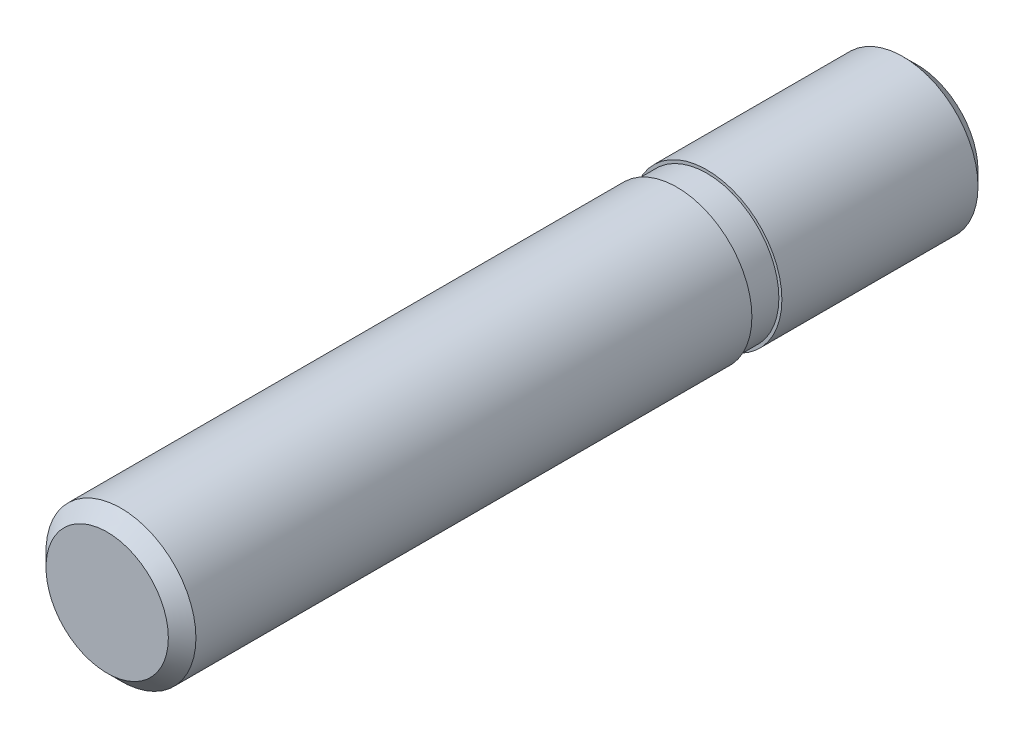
ISO-10303-21;
HEADER;
FILE_DESCRIPTION(('STEP AP214'),'2;1');
FILE_NAME('part.step','',(''),(''),'','','');
FILE_SCHEMA(('AUTOMOTIVE_DESIGN { 1 0 10303 214 1 1 1 1 }'));
ENDSEC;
DATA;
#1=APPLICATION_CONTEXT('core data for automotive mechanical design processes');
#2=APPLICATION_PROTOCOL_DEFINITION('international standard','automotive_design',2000,#1);
#3=PRODUCT_CONTEXT('',#1,'mechanical');
#4=PRODUCT('Part','Part','',(#3));
#5=PRODUCT_RELATED_PRODUCT_CATEGORY('part','',(#4));
#6=PRODUCT_DEFINITION_FORMATION('','',#4);
#7=PRODUCT_DEFINITION_CONTEXT('part definition',#1,'design');
#8=PRODUCT_DEFINITION('design','',#6,#7);
#9=PRODUCT_DEFINITION_SHAPE('','',#8);
#10=(LENGTH_UNIT() NAMED_UNIT(*) SI_UNIT(.MILLI.,.METRE.));
#11=(NAMED_UNIT(*) PLANE_ANGLE_UNIT() SI_UNIT($,.RADIAN.));
#12=(NAMED_UNIT(*) SI_UNIT($,.STERADIAN.) SOLID_ANGLE_UNIT());
#13=UNCERTAINTY_MEASURE_WITH_UNIT(LENGTH_MEASURE(1.E-05),#10,'distance_accuracy_value','');
#14=(GEOMETRIC_REPRESENTATION_CONTEXT(3) GLOBAL_UNCERTAINTY_ASSIGNED_CONTEXT((#13)) GLOBAL_UNIT_ASSIGNED_CONTEXT((#10,
#11,#12)) REPRESENTATION_CONTEXT('',''));
#15=CARTESIAN_POINT('',(0.,0.,0.));
#16=DIRECTION('',(0.,0.,1.));
#17=DIRECTION('',(1.,0.,0.));
#18=AXIS2_PLACEMENT_3D('',#15,#16,#17);
#19=CARTESIAN_POINT('',(0.,2.04,-14.));
#20=DIRECTION('',(0.,0.,-1.));
#21=DIRECTION('',(-1.,0.,0.));
#22=AXIS2_PLACEMENT_3D('',#19,#20,#21);
#23=PLANE('',#22);
#24=CARTESIAN_POINT('',(0.,0.,-14.));
#25=DIRECTION('',(0.,0.,1.));
#26=DIRECTION('',(1.,0.,0.));
#27=AXIS2_PLACEMENT_3D('',#24,#25,#26);
#28=CIRCLE('',#27,4.08000000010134);
#29=CARTESIAN_POINT('',(4.08000000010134,0.,-14.));
#30=VERTEX_POINT('',#29);
#31=EDGE_CURVE('E19',#30,#30,#28,.T.);
#32=ORIENTED_EDGE('',*,*,#31,.F.);
#33=EDGE_LOOP('',(#32));
#34=FACE_BOUND('',#33,.T.);
#35=ADVANCED_FACE('F12',(#34),#23,.T.);
#36=CARTESIAN_POINT('',(0.,0.,-13.080000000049));
#37=DIRECTION('',(0.,0.,1.));
#38=DIRECTION('',(1.,0.,0.));
#39=AXIS2_PLACEMENT_3D('',#36,#37,#38);
#40=CONICAL_SURFACE('',#39,5.0000000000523,0.785398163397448);
#41=CARTESIAN_POINT('',(0.,0.,-13.08));
#42=DIRECTION('',(0.,0.,1.));
#43=DIRECTION('',(1.,0.,0.));
#44=AXIS2_PLACEMENT_3D('',#41,#42,#43);
#45=CIRCLE('',#44,5.);
#46=CARTESIAN_POINT('',(5.,0.,-13.08));
#47=VERTEX_POINT('',#46);
#48=EDGE_CURVE('E23',#47,#47,#45,.T.);
#49=ORIENTED_EDGE('',*,*,#48,.F.);
#50=EDGE_LOOP('',(#49));
#51=FACE_BOUND('',#50,.T.);
#52=ORIENTED_EDGE('',*,*,#31,.T.);
#53=EDGE_LOOP('',(#52));
#54=FACE_BOUND('',#53,.T.);
#55=ADVANCED_FACE('F66',(#51,#54),#40,.T.);
#56=CARTESIAN_POINT('',(0.,0.,4.));
#57=DIRECTION('',(0.,0.,1.));
#58=DIRECTION('',(1.,0.,0.));
#59=AXIS2_PLACEMENT_3D('',#56,#57,#58);
#60=CYLINDRICAL_SURFACE('',#59,5.);
#61=CARTESIAN_POINT('',(0.,0.,0.));
#62=DIRECTION('',(0.,0.,1.));
#63=DIRECTION('',(1.,0.,0.));
#64=AXIS2_PLACEMENT_3D('',#61,#62,#63);
#65=CIRCLE('',#64,5.);
#66=CARTESIAN_POINT('',(5.,0.,0.));
#67=VERTEX_POINT('',#66);
#68=EDGE_CURVE('E28',#67,#67,#65,.T.);
#69=ORIENTED_EDGE('',*,*,#68,.F.);
#70=EDGE_LOOP('',(#69));
#71=FACE_BOUND('',#70,.T.);
#72=ORIENTED_EDGE('',*,*,#48,.T.);
#73=EDGE_LOOP('',(#72));
#74=FACE_BOUND('',#73,.T.);
#75=ADVANCED_FACE('F72',(#71,#74),#60,.T.);
#76=CARTESIAN_POINT('',(0.,0.,0.));
#77=DIRECTION('',(0.,0.,1.));
#78=DIRECTION('',(1.,0.,0.));
#79=AXIS2_PLACEMENT_3D('',#76,#77,#78);
#80=PLANE('',#79);
#81=CARTESIAN_POINT('',(0.,0.,0.));
#82=DIRECTION('',(0.,0.,1.));
#83=DIRECTION('',(1.,0.,0.));
#84=AXIS2_PLACEMENT_3D('',#81,#82,#83);
#85=CIRCLE('',#84,4.8);
#86=CARTESIAN_POINT('',(4.8,0.,0.));
#87=VERTEX_POINT('',#86);
#88=EDGE_CURVE('E8',#87,#87,#85,.T.);
#89=ORIENTED_EDGE('',*,*,#88,.F.);
#90=EDGE_LOOP('',(#89));
#91=FACE_BOUND('',#90,.T.);
#92=ORIENTED_EDGE('',*,*,#68,.T.);
#93=EDGE_LOOP('',(#92));
#94=FACE_BOUND('',#93,.T.);
#95=ADVANCED_FACE('F77',(#91,#94),#80,.T.);
#96=CARTESIAN_POINT('',(0.,0.,-3.47271292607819));
#97=DIRECTION('',(0.,0.,-1.));
#98=DIRECTION('',(-1.,0.,0.));
#99=AXIS2_PLACEMENT_3D('',#96,#97,#98);
#100=CYLINDRICAL_SURFACE('',#99,4.8);
#101=CARTESIAN_POINT('',(0.,0.,2.));
#102=DIRECTION('',(0.,0.,-1.));
#103=DIRECTION('',(-1.,0.,0.));
#104=AXIS2_PLACEMENT_3D('',#101,#102,#103);
#105=CIRCLE('',#104,4.8);
#106=CARTESIAN_POINT('',(-4.8,0.,2.));
#107=VERTEX_POINT('',#106);
#108=EDGE_CURVE('E44',#107,#107,#105,.T.);
#109=ORIENTED_EDGE('',*,*,#108,.T.);
#110=EDGE_LOOP('',(#109));
#111=FACE_BOUND('',#110,.T.);
#112=ORIENTED_EDGE('',*,*,#88,.T.);
#113=EDGE_LOOP('',(#112));
#114=FACE_BOUND('',#113,.T.);
#115=ADVANCED_FACE('F51',(#111,#114),#100,.T.);
#116=CARTESIAN_POINT('',(0.,0.,40.));
#117=DIRECTION('',(0.,0.,1.));
#118=DIRECTION('',(1.,0.,0.));
#119=AXIS2_PLACEMENT_3D('',#116,#117,#118);
#120=PLANE('',#119);
#121=CARTESIAN_POINT('',(0.,0.,40.));
#122=DIRECTION('',(0.,0.,1.));
#123=DIRECTION('',(1.,0.,0.));
#124=AXIS2_PLACEMENT_3D('',#121,#122,#123);
#125=CIRCLE('',#124,4.08);
#126=CARTESIAN_POINT('',(4.08,0.,40.));
#127=VERTEX_POINT('',#126);
#128=EDGE_CURVE('E40',#127,#127,#125,.T.);
#129=ORIENTED_EDGE('',*,*,#128,.T.);
#130=EDGE_LOOP('',(#129));
#131=FACE_BOUND('',#130,.T.);
#132=ADVANCED_FACE('F85',(#131),#120,.T.);
#133=CARTESIAN_POINT('',(0.,0.,40.));
#134=DIRECTION('',(0.,0.,-1.));
#135=DIRECTION('',(-1.,0.,0.));
#136=AXIS2_PLACEMENT_3D('',#133,#134,#135);
#137=CONICAL_SURFACE('',#136,4.08,0.78539816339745);
#138=CARTESIAN_POINT('',(0.,0.,39.08));
#139=DIRECTION('',(0.,0.,1.));
#140=DIRECTION('',(1.,0.,0.));
#141=AXIS2_PLACEMENT_3D('',#138,#139,#140);
#142=CIRCLE('',#141,5.);
#143=CARTESIAN_POINT('',(5.,0.,39.08));
#144=VERTEX_POINT('',#143);
#145=EDGE_CURVE('E31',#144,#144,#142,.F.);
#146=ORIENTED_EDGE('',*,*,#145,.F.);
#147=EDGE_LOOP('',(#146));
#148=FACE_BOUND('',#147,.T.);
#149=ORIENTED_EDGE('',*,*,#128,.F.);
#150=EDGE_LOOP('',(#149));
#151=FACE_BOUND('',#150,.T.);
#152=ADVANCED_FACE('F62',(#148,#151),#137,.T.);
#153=CARTESIAN_POINT('',(0.,0.,4.));
#154=DIRECTION('',(0.,0.,1.));
#155=DIRECTION('',(1.,0.,0.));
#156=AXIS2_PLACEMENT_3D('',#153,#154,#155);
#157=CYLINDRICAL_SURFACE('',#156,5.);
#158=CARTESIAN_POINT('',(0.,0.,2.));
#159=DIRECTION('',(0.,0.,1.));
#160=DIRECTION('',(1.,0.,0.));
#161=AXIS2_PLACEMENT_3D('',#158,#159,#160);
#162=CIRCLE('',#161,5.);
#163=CARTESIAN_POINT('',(5.,0.,2.));
#164=VERTEX_POINT('',#163);
#165=EDGE_CURVE('E35',#164,#164,#162,.T.);
#166=ORIENTED_EDGE('',*,*,#165,.T.);
#167=EDGE_LOOP('',(#166));
#168=FACE_BOUND('',#167,.T.);
#169=ORIENTED_EDGE('',*,*,#145,.T.);
#170=EDGE_LOOP('',(#169));
#171=FACE_BOUND('',#170,.T.);
#172=ADVANCED_FACE('F14',(#168,#171),#157,.T.);
#173=CARTESIAN_POINT('',(0.,0.,2.));
#174=DIRECTION('',(0.,0.,1.));
#175=DIRECTION('',(1.,0.,0.));
#176=AXIS2_PLACEMENT_3D('',#173,#174,#175);
#177=PLANE('',#176);
#178=ORIENTED_EDGE('',*,*,#108,.F.);
#179=EDGE_LOOP('',(#178));
#180=FACE_BOUND('',#179,.T.);
#181=ORIENTED_EDGE('',*,*,#165,.F.);
#182=EDGE_LOOP('',(#181));
#183=FACE_BOUND('',#182,.T.);
#184=ADVANCED_FACE('F53',(#180,#183),#177,.F.);
#185=CLOSED_SHELL('',(#35,#55,#75,#95,#115,#132,#152,#172,#184));
#186=MANIFOLD_SOLID_BREP('B1',#185);
#187=ADVANCED_BREP_SHAPE_REPRESENTATION('',(#18,#186),#14);
#188=SHAPE_DEFINITION_REPRESENTATION(#9,#187);
ENDSEC;
END-ISO-10303-21;
